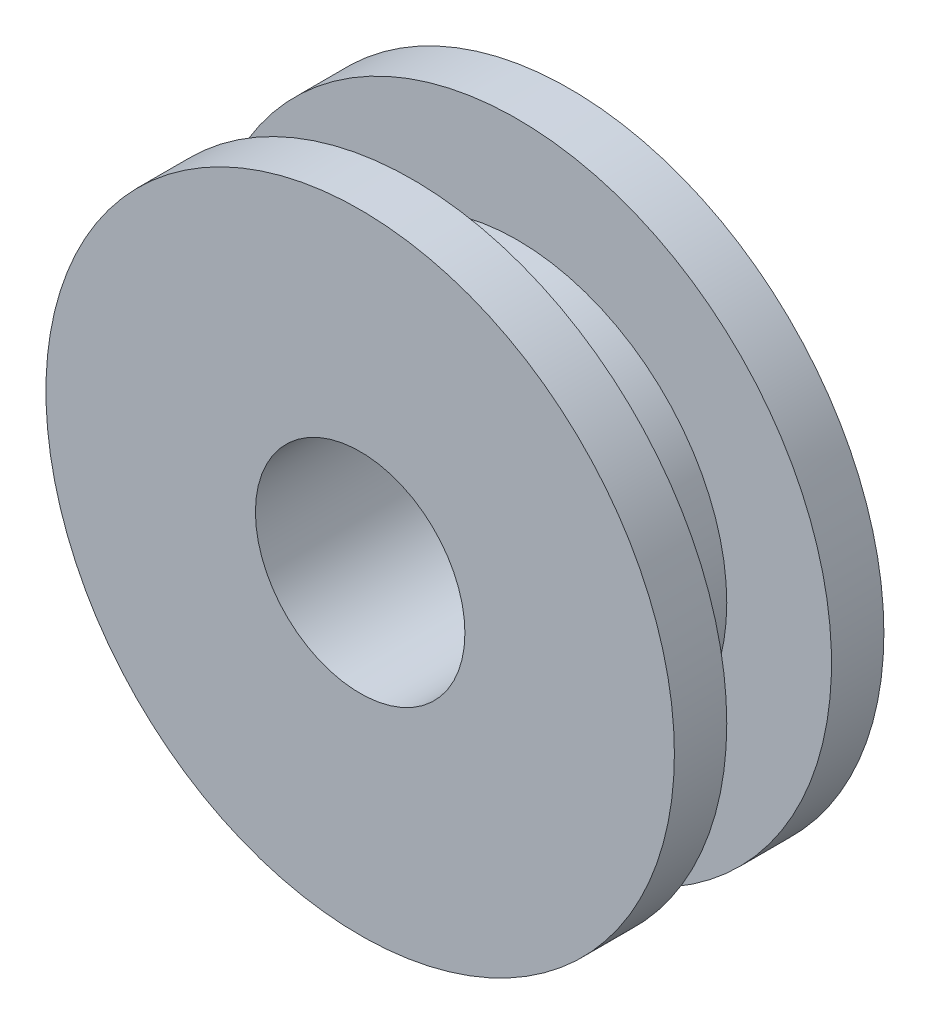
from build123d import *

# Parameters (mm, degrees)
IZIM1_R                     = 60
Y_KSEKLIK_EKSTR_ZYON2_DEPTH = 40
IZIM3_W                     = 20
IZIM3_H                     = 40
IZIM4_R                     = 20
KES_EKSTR_ZYON1_DEPTH       = 40


with BuildPart() as part:
    # izim1 → Y_kseklik-Ekstr_zyon2 (new body)
    with BuildSketch(Plane.XY):
        Circle(IZIM1_R)
    extrude(amount=Y_KSEKLIK_EKSTR_ZYON2_DEPTH)

    # Kes-S_p_r1: sweep along a curve in space
    with BuildLine() as kes_s_p_r1_path:
        ThreePointArc((60, 0, 40), (42.426406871, 42.426406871, 40), (0, 60, 40))
        ThreePointArc((0, 60, 40), (-42.426406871, 42.426406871, 40), (-60, 0, 40))
        ThreePointArc((-60, 0, 40), (-42.426406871, -42.426406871, 40), (0, -60, 40))
        ThreePointArc((0, -60, 40), (42.426406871, -42.426406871, 40), (60, 0, 40))
    # izim3 → Kes-S_p_r1 (sweep, cut)
    with BuildSketch(Plane(origin=(0, 0, 0), x_dir=(0, 0, -1), z_dir=(1, 0, 0))):
        with Locations((-20, 60)):
            Rectangle(IZIM3_W, IZIM3_H)
    sweep(path=kes_s_p_r1_path.line, mode=Mode.SUBTRACT)

    # izim4 → Kes-Ekstr_zyon1 (cut)
    with BuildSketch(Plane.XY.offset(40)):
        Circle(IZIM4_R)
    extrude(amount=-KES_EKSTR_ZYON1_DEPTH, mode=Mode.SUBTRACT)


solid = part.part
